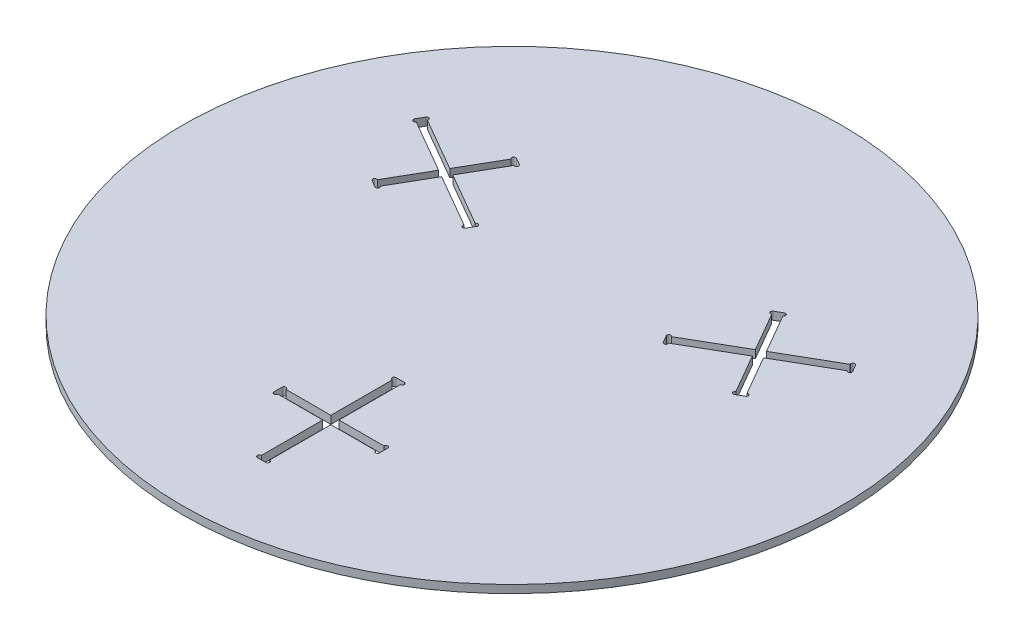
from build123d import *

# Parameters (mm, degrees)
TABLETOP_R                       = 500
TABLETOP_THICKNESS_EXTRUDE_DEPTH = 6
LEG_SLOT_CUT_DEPTH               = 708.208597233
LEG_SLOT_PATTERN_COUNT           = 3


with BuildPart() as part:
    # Tabletop → Tabletop_Thickness_Extrude (new, symmetric)
    with BuildSketch(Plane(origin=(0, 0, 0), x_dir=(1, 0, 0), z_dir=(0, 1, 0))):
        with Locations(Location((0, 0, 0), (0, 0, 270))):
            Circle(TABLETOP_R)
    extrude(amount=TABLETOP_THICKNESS_EXTRUDE_DEPTH, both=True)

    # Leg_Slots → Leg_Slot_Cut (cut, through all)
    with BuildSketch(Plane(origin=(0, 6, 0), x_dir=(1, 0, 0), z_dir=(0, 1, 0))):
        with BuildLine():
            Line((-6.2, -380), (6.2, -380))
            ThreePointArc((6.2, -380), (9.2, -377), (6.2, -374))
            Line((6.2, -374), (6.2, -281))
            Line((6.2, -281), (74.2, -281))
            ThreePointArc((74.2, -281), (77.2, -284), (80.2, -281))
            Line((80.2, -281), (80.2, -268.6))
            ThreePointArc((80.2, -268.6), (77.2, -265.6), (74.2, -268.6))
            Line((74.2, -268.6), (6.2, -268.6))
            Line((6.2, -268.6), (6.2, -175.6))
            ThreePointArc((6.2, -175.6), (9.2, -172.6), (6.2, -169.6))
            Line((6.2, -169.6), (-6.2, -169.6))
            ThreePointArc((-6.2, -169.6), (-9.2, -172.6), (-6.2, -175.6))
            Line((-6.2, -175.6), (-6.2, -268.6))
            Line((-6.2, -268.6), (-74.2, -268.6))
            ThreePointArc((-74.2, -268.6), (-77.2, -265.6), (-80.2, -268.6))
            Line((-80.2, -268.6), (-80.2, -281))
            ThreePointArc((-80.2, -281), (-77.2, -284), (-74.2, -281))
            Line((-74.2, -281), (-6.2, -281))
            Line((-6.2, -281), (-6.2, -374))
            ThreePointArc((-6.2, -374), (-9.2, -377), (-6.2, -380))
        make_face()
    leg_slot_cut = extrude(amount=-LEG_SLOT_CUT_DEPTH, mode=Mode.SUBTRACT)

    # Leg_Slot_Pattern: Leg_Slot_Cut ×3 about axis
    leg_slot_pattern_axis = Axis((0, 0, 0), (0, 1, 0))
    for i in range(1, LEG_SLOT_PATTERN_COUNT):
        add(leg_slot_cut.rotate(leg_slot_pattern_axis, i * 360 / LEG_SLOT_PATTERN_COUNT), mode=Mode.SUBTRACT)


solid = part.part
